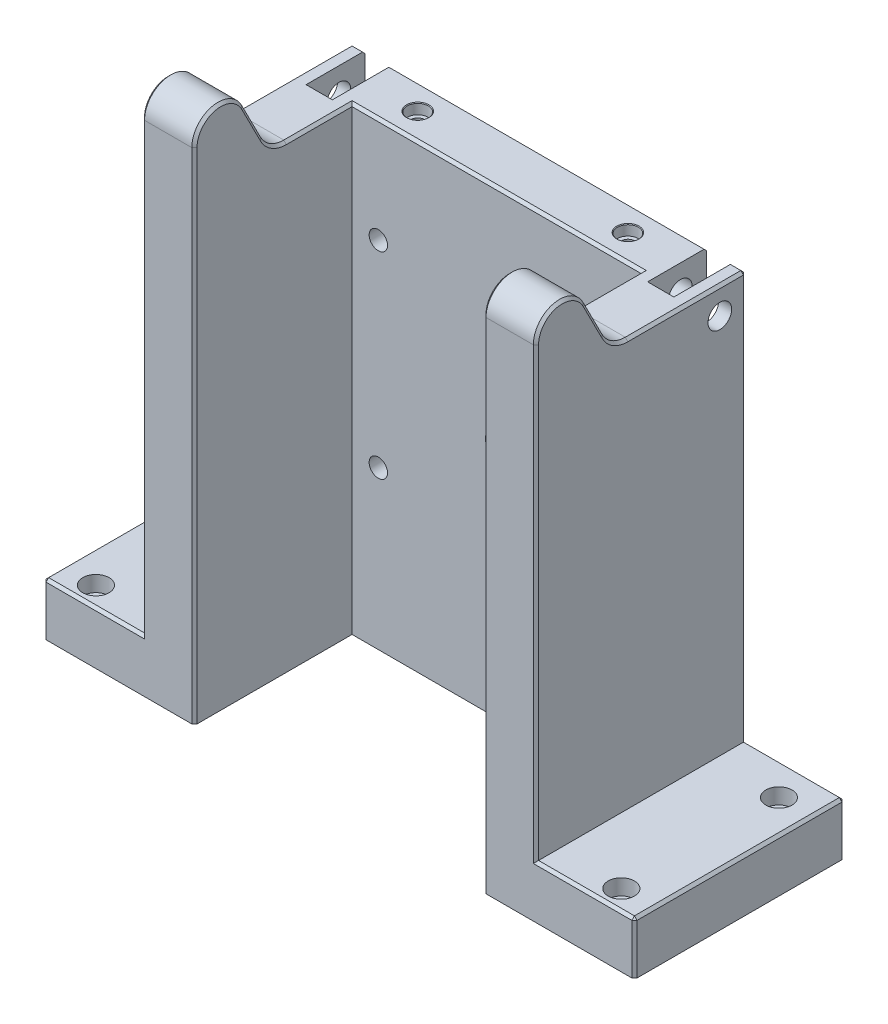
from build123d import *

# Parameters (mm, degrees)
BOSS_EXTRU_1_DEPTH                                 = 160
CHAMBRAGE_POUR_VIS_T_TE_HEXAGONALE_M12_D           = 13.5
CHAMBRAGE_POUR_VIS_T_TE_HEXAGONALE_M12_CBORE_D     = 20
CHAMBRAGE_POUR_VIS_T_TE_HEXAGONALE_M12_CBORE_DEPTH = 12
TROU_TARAUD_M161_D                                 = 14
DIAM_TRE_DU_PER_AGE_16_0_16_1_D                    = 16
ESQUISSE10_W                                       = 220
ESQUISSE10_H                                       = 120
ENL_V_MAT_EXTRU_1_DEPTH                            = 446.785823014
TROU_TARAUD_M121_D                                 = 10.2
TROU_TARAUD_M121_DEPTH                             = 33
TROU_TARAUD_M121_TIP                               = 3.064389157
ESQUISSE13_R                                       = 8
AL_SAGE_D16X8_POUR_PION_DE_CENTRAGE_DEPTH          = 8
BOSS_EXTRU_3_DEPTH                                 = 40
BOSS_EXTRU_4_START                                 = -40
BOSS_EXTRU_4_DEPTH                                 = 40
ESQUISSE16_W                                       = 20
ESQUISSE16_H                                       = 45
ENL_V_MAT_EXTRU_2_DEPTH                            = 50
CONG_1_R                                           = 8
CHANFREIN1_SIZE                                    = 2
CHANFREIN2_SIZE                                    = 0.5
DIAM_TRE_DU_PER_AGE_18_0_18_2_D                    = 18
DIAM_TRE_DU_PER_AGE_18_0_18_2_DEPTH                = 20
DIAM_TRE_DU_PER_AGE_18_0_18_2_TIP                  = 5.407745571
CHANFREIN3_SIZE                                    = 1


with BuildPart() as part:
    # Esquisse1 → Boss.-Extru.1 (new body)
    with BuildSketch(Plane.XY):
        Polygon((-225, 0), (225, 0), (225, 40), (150, 40), (150, 350), (-150, 350), (-150, 40), (-225, 40), align=None)
    extrude(amount=BOSS_EXTRU_1_DEPTH)

    # Chambrage pour vis _ t_te hexagonale M12 (through all)
    with Locations(Plane(origin=(0, 40, 0), x_dir=(-1, 0, 0), z_dir=(0, 1, 0))):
        with Locations((200, 25), (-200, 25), (200, 145), (-200, 145)):
            CounterBoreHole(CHAMBRAGE_POUR_VIS_T_TE_HEXAGONALE_M12_D / 2, CHAMBRAGE_POUR_VIS_T_TE_HEXAGONALE_M12_CBORE_D / 2, CHAMBRAGE_POUR_VIS_T_TE_HEXAGONALE_M12_CBORE_DEPTH)

    # Trou taraud_ M161 (through all)
    with Locations(Plane.XY.offset(160)):
        with Locations((90, 270), (-90, 270), (-90, 120)):
            Hole(TROU_TARAUD_M161_D / 2)

    # Diam_tre du per_age _16.0 _16_1 (through all)
    with Locations(Plane.XY.offset(160)):
        with Locations((0, 180)):
            Hole(DIAM_TRE_DU_PER_AGE_16_0_16_1_D / 2)

    # Esquisse10 → Enl_v. mat.-Extru.1 (cut, through all)
    with BuildSketch(Plane.XZ):
        with Locations((0, 100)):
            Rectangle(ESQUISSE10_W, ESQUISSE10_H)
    extrude(amount=-ENL_V_MAT_EXTRU_1_DEPTH, mode=Mode.SUBTRACT)

    # Trou taraud_ M121
    with Locations(Plane(origin=(0, 350, 0), x_dir=(-1, 0, 0), z_dir=(0, 1, 0))):
        with Locations((-80, 20), (80, 20)):
            Hole(TROU_TARAUD_M121_D / 2, depth=TROU_TARAUD_M121_DEPTH)
            with Locations((0, 0, -(TROU_TARAUD_M121_DEPTH + TROU_TARAUD_M121_TIP / 2))):  # 118° drill point
                Cone(0, TROU_TARAUD_M121_D / 2, TROU_TARAUD_M121_TIP, mode=Mode.SUBTRACT)

    # Esquisse13 → Al_sage d16x8 pour pion de centrage (cut)
    with BuildSketch(Plane(origin=(0, 350, 0), x_dir=(1, 0, 0), z_dir=(0, 1, 0))):
        with Locations(Location((-80, -20, 0), (0, 0, 270))):
            Circle(ESQUISSE13_R)
        with Locations(Location((80, -20, 0), (0, 0, 270))):
            Circle(ESQUISSE13_R)
    extrude(amount=-AL_SAGE_D16X8_POUR_PION_DE_CENTRAGE_DEPTH, mode=Mode.SUBTRACT)

    # Esquisse14 → Boss.-Extru.3 (add)
    with BuildSketch(Plane.ZY.offset(150)):
        with BuildLine():
            Line((122.182863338, 389.085683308), (107.817136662, 360.914316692))
            ThreePointArc((107.817136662, 360.914316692), (100.447160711, 352.945474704), (90, 350))
            Line((90, 350), (160, 350))
            Line((160, 350), (160, 380))
            ThreePointArc((160, 380), (144.672112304, 399.44662867), (122.182863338, 389.085683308))
        make_face()
    extrude(amount=-BOSS_EXTRU_3_DEPTH)

    # Esquisse15 → Boss.-Extru.4 (add)
    with BuildSketch(Plane(origin=(150, 0, 0), x_dir=(0, 0, -1), z_dir=(1, 0, 0)).offset(BOSS_EXTRU_4_START)):
        with BuildLine():
            Line((-122.182863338, 389.085683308), (-107.817136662, 360.914316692))
            ThreePointArc((-107.817136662, 360.914316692), (-100.447160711, 352.945474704), (-90, 350))
            Line((-90, 350), (-160, 350))
            Line((-160, 350), (-160, 380))
            ThreePointArc((-160, 380), (-144.672112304, 399.44662867), (-122.182863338, 389.085683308))
        make_face()
    extrude(amount=BOSS_EXTRU_4_DEPTH)

    # Esquisse16 → Enl_v. mat.-Extru.2 (cut)
    with BuildSketch(Plane(origin=(0, 350, 0), x_dir=(1, 0, 0), z_dir=(0, 1, 0))):
        with Locations((130, -22.5)):
            Rectangle(ESQUISSE16_W, ESQUISSE16_H)
        with Locations((-130, -22.5)):
            Rectangle(ESQUISSE16_W, ESQUISSE16_H)
    extrude(amount=-ENL_V_MAT_EXTRU_2_DEPTH, mode=Mode.SUBTRACT)

    # Cong_1
    cong_1_edges = [part.edges().sort_by_distance(p)[0] for p in [
        (140, 300, 22.5),
        (120, 300, 22.5),
        (-140, 300, 22.5),
        (-120, 300, 22.5),
    ]]
    fillet(cong_1_edges, radius=CONG_1_R)

    # Esquisse17 → Diam_tre du per_age _18.0 _18_1 (revolve, cut)
    with BuildSketch(Plane(origin=(-150, 330, 20), x_dir=(0, 0, 1), z_dir=(0, 1, 0))):
        Polygon((0, 0), (0, 55.407745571), (9, 50), (9, 0), align=None)
    diam_tre_du_per_age_18_0_18_1 = revolve(axis=Axis((-156.35, 330, 20), (1, 0, 0)), mode=Mode.SUBTRACT)

    # Sym_trie1: Diam_tre du per_age _18.0 _18_1 across plane
    add(diam_tre_du_per_age_18_0_18_1.mirror(Plane(origin=(0, 0, 0), x_dir=(0, 0, 1), z_dir=(1, 0, 0))), mode=Mode.SUBTRACT)

    # Chanfrein1
    chanfrein1_edges = [part.edges().sort_by_distance(p)[0] for p in [
        (225, 20, 160),
        (-225, 20, 0),
        (-110, 350, 65),
        (-150, 350, 45),
        (-150, 399.44662867, 144.672112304),
        (-150, 375, 115),
        (-150, 352.945474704, 100.447160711),
        (-110, 352.945474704, 100.447160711),
        (-110, 375, 115),
        (-110, 399.44662867, 144.672112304),
        (187.5, 40, 160),
        (150, 350, 45),
        (150, 399.44662867, 144.672112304),
        (150, 352.945474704, 100.447160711),
        (150, 375, 115),
        (110, 399.44662867, 144.672112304),
        (110, 375, 115),
        (110, 352.945474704, 100.447160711),
        (-225, 40, 80),
        (225, 40, 80),
        (0, 350, 0),
        (-145, 350, 0),
        (150, 210, 160),
        (-150, 210, 160),
        (-187.5, 40, 160),
        (-225, 20, 160),
        (-187.5, 40, 0),
        (-110, 190, 160),
        (0, 350, 40),
        (110, 350, 65),
        (110, 190, 160),
        (-150, 195, 0),
        (145, 350, 0),
        (150, 195, 0),
        (187.5, 40, 0),
        (225, 20, 0),
    ]]
    chamfer(chanfrein1_edges, length=CHANFREIN1_SIZE)

    # Chanfrein2
    chanfrein2_edges = [part.edges().sort_by_distance(p)[0] for p in [
        (-80, 350, 12),
        (80, 350, 12),
        (8, 180, 0),
        (8, 180, 40),
    ]]
    chamfer(chanfrein2_edges, length=CHANFREIN2_SIZE)

    # Diam_tre du per_age _18.0 _18_2
    with Locations(Plane.XZ):
        with Locations((160, 65), (-160, 65)):
            Hole(DIAM_TRE_DU_PER_AGE_18_0_18_2_D / 2, depth=DIAM_TRE_DU_PER_AGE_18_0_18_2_DEPTH)
            with Locations((0, 0, -(DIAM_TRE_DU_PER_AGE_18_0_18_2_DEPTH + DIAM_TRE_DU_PER_AGE_18_0_18_2_TIP / 2))):  # 118° drill point
                Cone(0, DIAM_TRE_DU_PER_AGE_18_0_18_2_D / 2, DIAM_TRE_DU_PER_AGE_18_0_18_2_TIP, mode=Mode.SUBTRACT)

    # Chanfrein3
    chanfrein3_edges = [part.edges().sort_by_distance(p)[0] for p in [
        (-151, 0, 65),
        (169, 0, 65),
    ]]
    chamfer(chanfrein3_edges, length=CHANFREIN3_SIZE)


solid = part.part
